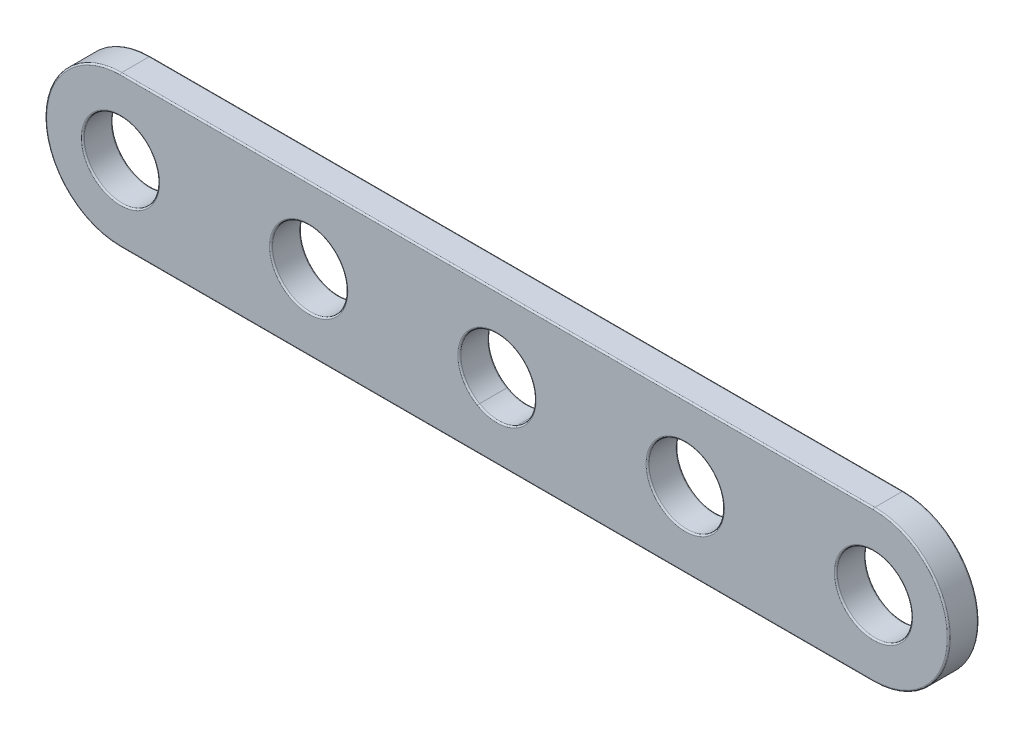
from build123d import *

# Parameters (mm, degrees)
BASE_EXTRUDE_DEPTH = 20
SKETCH2_R          = 25
CUT_EXTRUDE1_DEPTH = 560.374650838
LPATTERN1_COUNT    = 5
LPATTERN1_PITCH    = 125
FILLET1_R          = 1


with BuildPart() as part:
    # Sketch1 → Base-Extrude (new body)
    with BuildSketch(Plane.XY):
        with BuildLine():
            Line((0, 0), (500, 0))
            ThreePointArc((500, 0), (550, 50), (500, 100))
            Line((500, 100), (0, 100))
            ThreePointArc((0, 100), (-50, 50), (0, 0))
        make_face()
    extrude(amount=BASE_EXTRUDE_DEPTH)

    # Sketch2 → Cut-Extrude1 (cut, through all)
    with BuildSketch(Plane.XY.offset(20)):
        with Locations((0, 50)):
            Circle(SKETCH2_R)
    cut_extrude1 = extrude(amount=-CUT_EXTRUDE1_DEPTH, mode=Mode.SUBTRACT)

    # LPattern1: Cut-Extrude1 ×5
    with Locations(*[(i * LPATTERN1_PITCH, 0, 0) for i in range(1, LPATTERN1_COUNT)]):
        add(cut_extrude1, mode=Mode.SUBTRACT)

    # Fillet1
    fillet1_edges = [part.edges().sort_by_distance(p)[0] for p in [
        (550, 50, 20),
        (250, 100, 20),
        (-25, 50, 0),
        (-25, 50, 20),
        (100, 50, 0),
        (100, 50, 20),
        (225, 50, 0),
        (225, 50, 20),
        (350, 50, 0),
        (350, 50, 20),
        (475, 50, 0),
        (475, 50, 20),
        (225, 50, 0),
        (225, 50, 0),
        (225, 50, 0),
        (225, 50, 20),
        (225, 50, 20),
        (225, 50, 20),
        (-50, 50, 20),
        (250, 100, 0),
        (550, 50, 0),
        (250, 0, 0),
        (-50, 50, 0),
        (250, 0, 20),
    ]]
    fillet(fillet1_edges, radius=FILLET1_R)


solid = part.part
